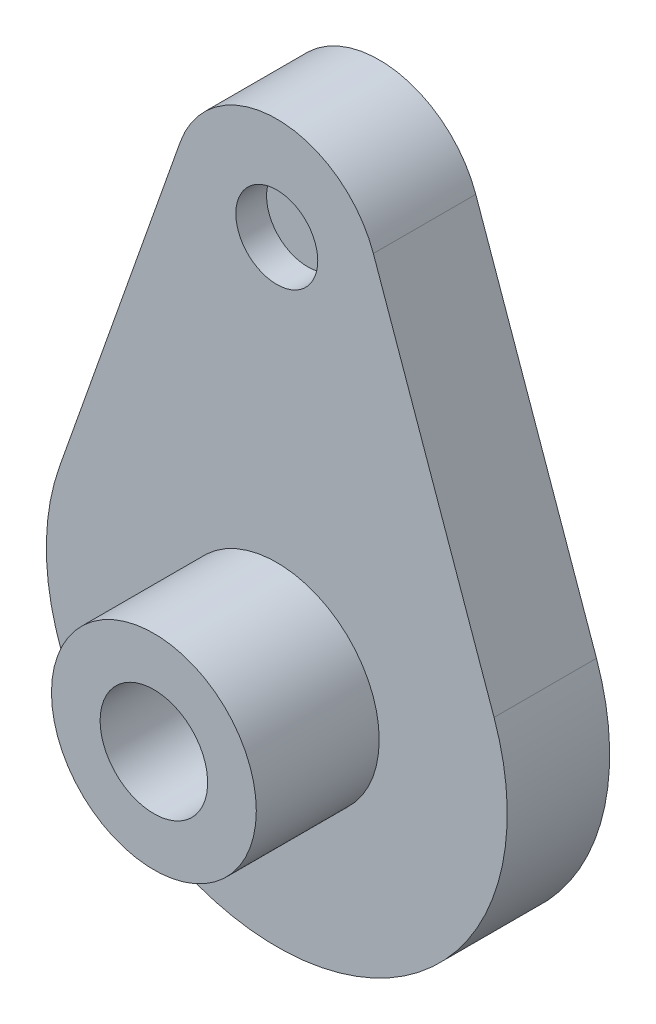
from build123d import *

# Parameters (mm, degrees)
P_IDAT_VYSUNUT_M1_DEPTH  = 4
SKICA2_R                 = 4
P_IDAT_VYSUNUT_M2_DEPTH  = 4.8
SKICA3_R                 = 2.1
SKICA3_R_2               = 1.6
ODEBRAT_VYSUNUT_M1_DEPTH = 23.791226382
ODEBRAT_VYSUNUT_M2_DEPTH = 2.6
SKICA5_R                 = 1.6
P_IDAT_VYSUNUT_M3_DEPTH  = 0.2


with BuildPart() as part:
    # Skica1 → P_idat vysunut_m1 (new body)
    with BuildSketch(Plane.XY):
        with BuildLine():
            Line((-3.771236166, 16.333333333), (-8.485281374, 3))
            ThreePointArc((-8.485281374, 3), (0, -9), (8.485281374, 3))
            Line((8.485281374, 3), (3.771236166, 16.333333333))
            ThreePointArc((3.771236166, 16.333333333), (0, 19), (-3.771236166, 16.333333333))
        make_face()
    extrude(amount=P_IDAT_VYSUNUT_M1_DEPTH)

    # Skica2 → P_idat vysunut_m2 (add)
    with BuildSketch(Plane.XY.offset(4)):
        Circle(SKICA2_R)
    extrude(amount=P_IDAT_VYSUNUT_M2_DEPTH)

    # Skica3 → Odebrat vysunut_m1 (cut, through all)
    with BuildSketch(Plane(origin=(0, 0, 0), x_dir=(-1, 0, 0), z_dir=(0, 0, -1))):
        Circle(SKICA3_R)
        with Locations((0, 15)):
            Circle(SKICA3_R_2)
    extrude(amount=-ODEBRAT_VYSUNUT_M1_DEPTH, mode=Mode.SUBTRACT)

    # Skica4 → Odebrat vysunut_m2 (cut)
    with BuildSketch(Plane(origin=(0, 0, 0), x_dir=(-1, 0, 0), z_dir=(0, 0, -1))):
        Polygon((3.233161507, 15), (1.616580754, 17.8), (-1.616580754, 17.8), (-3.233161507, 15), (-1.616580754, 12.2), (1.616580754, 12.2), align=None)
    extrude(amount=-ODEBRAT_VYSUNUT_M2_DEPTH, mode=Mode.SUBTRACT)

    # Skica5 → P_idat vysunut_m3 (add)
    with BuildSketch(Plane(origin=(0, 0, 2.6), x_dir=(-1, 0, 0), z_dir=(0, 0, -1))):
        with Locations((0, 15)):
            Circle(SKICA5_R)
    extrude(amount=-P_IDAT_VYSUNUT_M3_DEPTH)


solid = part.part
